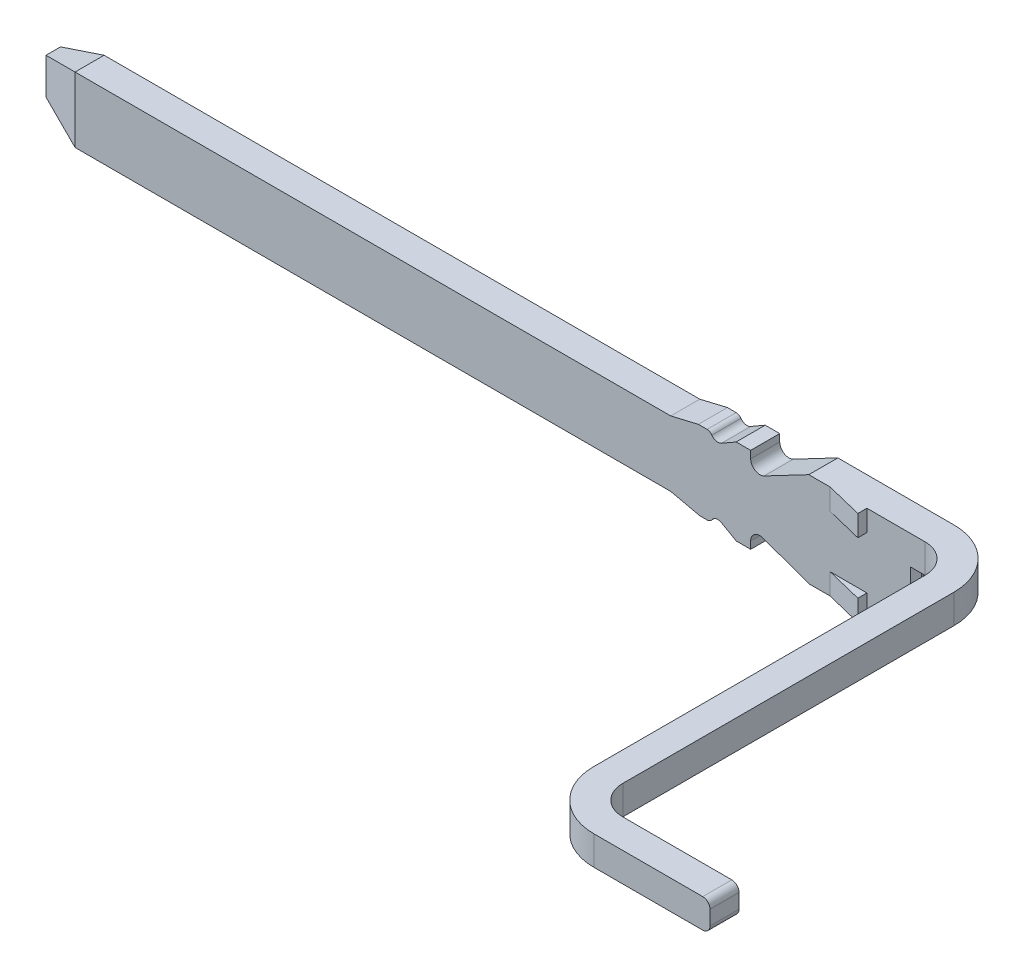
from build123d import *

# Parameters (mm, degrees)
RESSALTO_EXTRUS_O1_DEPTH = 0.2
RESSALTO_EXTRUS_O2_DEPTH = 0.2
CORTE_EXTRUS_O1_DEPTH    = 1
FILETE1_R                = 0.05
RESSALTO_EXTRUS_O3_DEPTH = 0.145
PADR_O_LINEAR1_COUNT     = 2
PADR_O_LINEAR1_PITCH     = 0.505
CORTE_EXTRUS_O2_DEPTH    = 0.3


with BuildPart() as part:
    # Esbo_o1 → Ressalto-extrus_o1 (new body)
    with BuildSketch(Plane.XY):
        with BuildLine():
            Line((76.710328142, 206.616112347), (76.710328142, 206.416112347))
            Line((76.710328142, 206.416112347), (76.657349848, 206.416112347))
            Line((76.657349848, 206.416112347), (76.657349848, 206.116112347))
            Line((76.657349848, 206.116112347), (76.645328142, 206.116112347))
            Line((76.645328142, 206.116112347), (76.610328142, 206.116112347))
            Line((76.610328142, 206.116112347), (76.560328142, 206.116112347))
            ThreePointArc((76.560328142, 206.116112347), (76.524972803, 206.101467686), (76.510328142, 206.066112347))
            Line((76.510328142, 206.066112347), (76.510328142, 205.966112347))
            Line((76.510328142, 205.966112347), (76.110328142, 205.966112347))
            Line((76.110328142, 205.966112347), (76.081970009, 205.966112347))
            Line((76.081970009, 205.966112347), (75.910328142, 205.966112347))
            Line((75.910328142, 205.966112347), (75.595453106, 206.080717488))
            ThreePointArc((75.595453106, 206.080717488), (75.537376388, 206.073071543), (75.510328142, 206.021112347))
            Line((75.510328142, 206.021112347), (75.510328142, 205.971112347))
            Line((75.510328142, 205.971112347), (75.410328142, 205.971112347))
            Line((75.410328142, 205.971112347), (75.309933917, 206.02907498))
            ThreePointArc((75.309933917, 206.02907498), (75.273690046, 206.034493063), (75.243486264, 206.013739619))
            ThreePointArc((75.243486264, 206.013739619), (75.229104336, 206.000793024), (75.210328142, 205.996112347))
            Line((75.210328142, 205.996112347), (75.160328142, 205.996112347))
            Line((75.160328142, 205.996112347), (74.960328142, 206.041112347))
            Line((74.960328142, 206.041112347), (70.860328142, 206.041112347))
            Line((70.860328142, 206.041112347), (70.560328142, 206.141112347))
            Line((70.560328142, 206.141112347), (70.560328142, 206.391112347))
            Line((70.560328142, 206.391112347), (70.860328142, 206.491112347))
            Line((70.860328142, 206.491112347), (74.960328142, 206.491112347))
            Line((74.960328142, 206.491112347), (75.150344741, 206.536112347))
            Line((75.150344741, 206.536112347), (75.210328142, 206.536112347))
            ThreePointArc((75.210328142, 206.536112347), (75.229104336, 206.53143167), (75.243486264, 206.518485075))
            ThreePointArc((75.243486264, 206.518485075), (75.273690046, 206.497731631), (75.309933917, 206.503149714))
            Line((75.309933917, 206.503149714), (75.410328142, 206.561112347))
            Line((75.410328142, 206.561112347), (75.510328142, 206.561112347))
            Line((75.510328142, 206.561112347), (75.510328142, 206.511112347))
            ThreePointArc((75.510328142, 206.511112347), (75.540942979, 206.456830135), (75.60323487, 206.454946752))
            Line((75.60323487, 206.454946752), (75.910328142, 206.616112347))
            Line((75.910328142, 206.616112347), (76.081970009, 206.616112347))
            Line((76.081970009, 206.616112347), (76.110328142, 206.616112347))
            Line((76.110328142, 206.616112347), (76.710328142, 206.616112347))
        make_face()
    extrude(amount=RESSALTO_EXTRUS_O1_DEPTH)

    # Esbo_o2 → Ressalto-extrus_o2 (add)
    with BuildSketch(Plane.XZ.offset(-206.416112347)):
        with BuildLine():
            Line((76.710328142, 0), (76.710328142, 0.2))
            ThreePointArc((76.710328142, 0.2), (76.851749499, 0.258578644), (76.910328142, 0.4))
            Line((76.910328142, 0.4), (76.910328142, 2.68))
            ThreePointArc((76.910328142, 2.68), (77.02748543, 2.962842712), (77.310328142, 3.08))
            Line((77.310328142, 3.08), (78.110328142, 3.08))
            Line((78.110328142, 3.08), (78.110328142, 2.88))
            Line((78.110328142, 2.88), (77.310328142, 2.88))
            ThreePointArc((77.310328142, 2.88), (77.168906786, 2.821421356), (77.110328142, 2.68))
            Line((77.110328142, 2.68), (77.110328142, 0.4))
            ThreePointArc((77.110328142, 0.4), (76.993170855, 0.117157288), (76.710328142, 0))
        make_face()
    extrude(amount=-RESSALTO_EXTRUS_O2_DEPTH)

    # Esbo_o3 → Corte-extrus_o1 (cut)
    with BuildSketch(Plane(origin=(0, 206.491112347, 0), x_dir=(1, 0, 0), z_dir=(0, 1, 0))):
        Polygon((70.560328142, -0.1), (70.475949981, -0.1), (70.475949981, -0.288700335), (70.860328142, -0.288700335), (70.860328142, -0.2), align=None)
    extrude(amount=-CORTE_EXTRUS_O1_DEPTH, mode=Mode.SUBTRACT)

    # Filete1
    filete1_edges = [part.edges().sort_by_distance(p)[0] for p in [
        (78.110328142, 206.616112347, 2.98),
        (78.110328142, 206.416112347, 2.98),
    ]]
    fillet(filete1_edges, radius=FILETE1_R)

    # Esbo_o4 → Ressalto-extrus_o3 (add)
    with BuildSketch(Plane(origin=(0, 206.616112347, 0), x_dir=(1, 0, 0), z_dir=(0, 1, 0))):
        Polygon((76.057628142, -0.2), (76.310328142, -0.2624), (76.310328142, -0.2), align=None)
    ressalto_extrus_o3 = extrude(amount=-RESSALTO_EXTRUS_O3_DEPTH)

    # Padr_o linear1: Ressalto-extrus_o3 ×2
    with Locations(*[(0, -i * PADR_O_LINEAR1_PITCH, 0) for i in range(1, PADR_O_LINEAR1_COUNT)]):
        add(ressalto_extrus_o3)

    # Esbo_o5 → Corte-extrus_o2 (cut)
    with BuildSketch(Plane.XZ.offset(-206.116112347)):
        Polygon((76.657349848, 0.16), (76.645349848, 0.16), (76.608838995, 0.2), (76.608838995, 0.232444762), (76.679680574, 0.232444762), (76.679680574, 0.16), align=None)
        Polygon((76.608838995, 0), (76.645349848, 0.04), (76.679680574, 0.04), (76.679680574, -0.014078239), (76.608838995, -0.014078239), align=None)
    extrude(amount=-CORTE_EXTRUS_O2_DEPTH, mode=Mode.SUBTRACT)


solid = part.part
